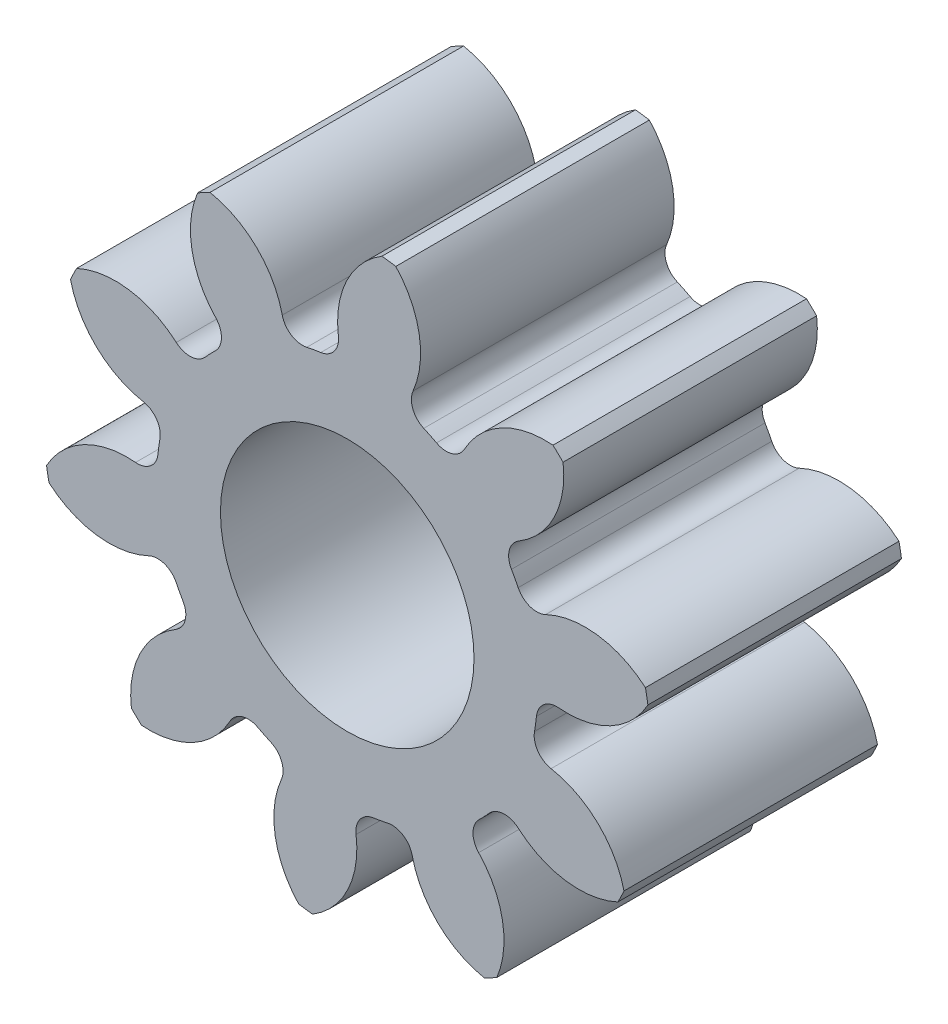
from build123d import *

# Parameters (mm, degrees)
SKETCH3_R         = 121.92
GEARBODY_DEPTH    = 101.6
TOOTHCUT_DEPTH    = 201.128790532
CIRPATTERN1_COUNT = 10
BOREDIA_R         = 50.8
BORE_DEPTH        = 12700


with BuildPart() as part:
    # Sketch3 → gearBody (new body)
    with BuildSketch(Plane.XY):
        Circle(SKETCH3_R)
    extrude(amount=GEARBODY_DEPTH)

    # Sketch2 → toothCut (cut, through all)
    with BuildSketch(Plane.XY):
        with BuildLine():
            ThreePointArc((75.039916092, -13.245791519), (75.48257071, -10.43175532), (75.819735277, -7.603140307))
            ThreePointArc((75.819735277, -7.603140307), (78.788631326, -2.046445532), (84.809985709, -0.193207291))
            ThreePointArc((84.809985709, -0.193207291), (106.867115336, 4.719342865), (121.92, 21.573445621))
            ThreePointArc((121.92, 21.573445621), (122.648254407, -16.950092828), (111.498884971, -53.832133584))
            ThreePointArc((111.498884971, -53.832133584), (101.581423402, -33.527107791), (81.683451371, -22.816326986))
            ThreePointArc((81.683451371, -22.816326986), (76.390433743, -19.399432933), (75.039916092, -13.245791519))
        make_face()
    toothcut = extrude(amount=TOOTHCUT_DEPTH, mode=Mode.SUBTRACT)

    # CirPattern1: toothCut ×10 about axis
    cirpattern1_axis = Axis((0, 0, 0), (0, 0, 1))
    for i in range(1, CIRPATTERN1_COUNT):
        add(toothcut.rotate(cirpattern1_axis, i * 360 / CIRPATTERN1_COUNT), mode=Mode.SUBTRACT)

    # boreDia → bore (cut, symmetric)
    with BuildSketch(Plane.XY):
        Circle(BOREDIA_R)
    extrude(amount=BORE_DEPTH, both=True, mode=Mode.SUBTRACT)


solid = part.part
